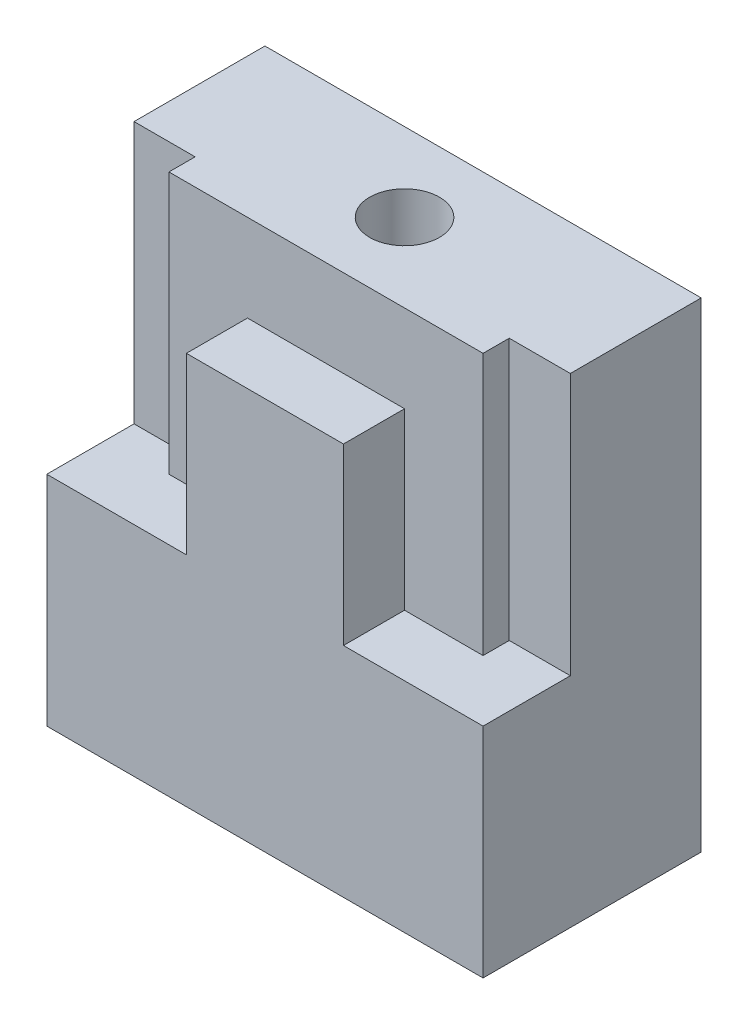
from build123d import *

# Parameters (mm, degrees)
SKETCH_1_W          = 50
SKETCH_1_H          = 25
EXTRUDE_1_DEPTH     = 55
SKETCH_2_R          = 4
CUT_EXTRUDE_1_DEPTH = 55
SKETCH_3_W          = 18
SKETCH_3_H          = 7
CUT_EXTRUDE_2_DEPTH = 10
CUT_EXTRUDE_3_DEPTH = 30


with BuildPart() as part:
    # Sketch 1 → Extrude 1 (new body)
    with BuildSketch(Plane(origin=(0, 0, 0), x_dir=(1, 0, 0), z_dir=(0, 1, 0))):
        Rectangle(SKETCH_1_W, SKETCH_1_H)
    extrude(amount=EXTRUDE_1_DEPTH)

    # Sketch 2 → Cut-Extrude 1 (cut)
    with BuildSketch(Plane(origin=(0, 55, 0), x_dir=(1, 0, 0), z_dir=(0, 1, 0))):
        with Locations(Location((0, 3.5, 0), (0, 0, 270))):
            Circle(SKETCH_2_R)
    extrude(amount=-CUT_EXTRUDE_1_DEPTH, mode=Mode.SUBTRACT)

    # Sketch 3 → Cut-Extrude 2 (cut)
    with BuildSketch(Plane(origin=(0, 55, 0), x_dir=(1, 0, 0), z_dir=(0, 1, 0))):
        with Locations((0, -9)):
            Rectangle(SKETCH_3_W, SKETCH_3_H)
    extrude(amount=-CUT_EXTRUDE_2_DEPTH, mode=Mode.SUBTRACT)

    # Sketch 4 → Cut-Extrude 3 (cut)
    with BuildSketch(Plane(origin=(0, 55, 0), x_dir=(1, 0, 0), z_dir=(0, 1, 0))):
        Polygon((-9, -5.5), (-18, -5.5), (-18, -2.5), (-25, -2.5), (-25, -12.5), (-9, -12.5), align=None)
        Polygon((9, -12.5), (9, -5.5), (18, -5.5), (18, -2.5), (25, -2.5), (25, -12.5), align=None)
    extrude(amount=-CUT_EXTRUDE_3_DEPTH, mode=Mode.SUBTRACT)


solid = part.part
